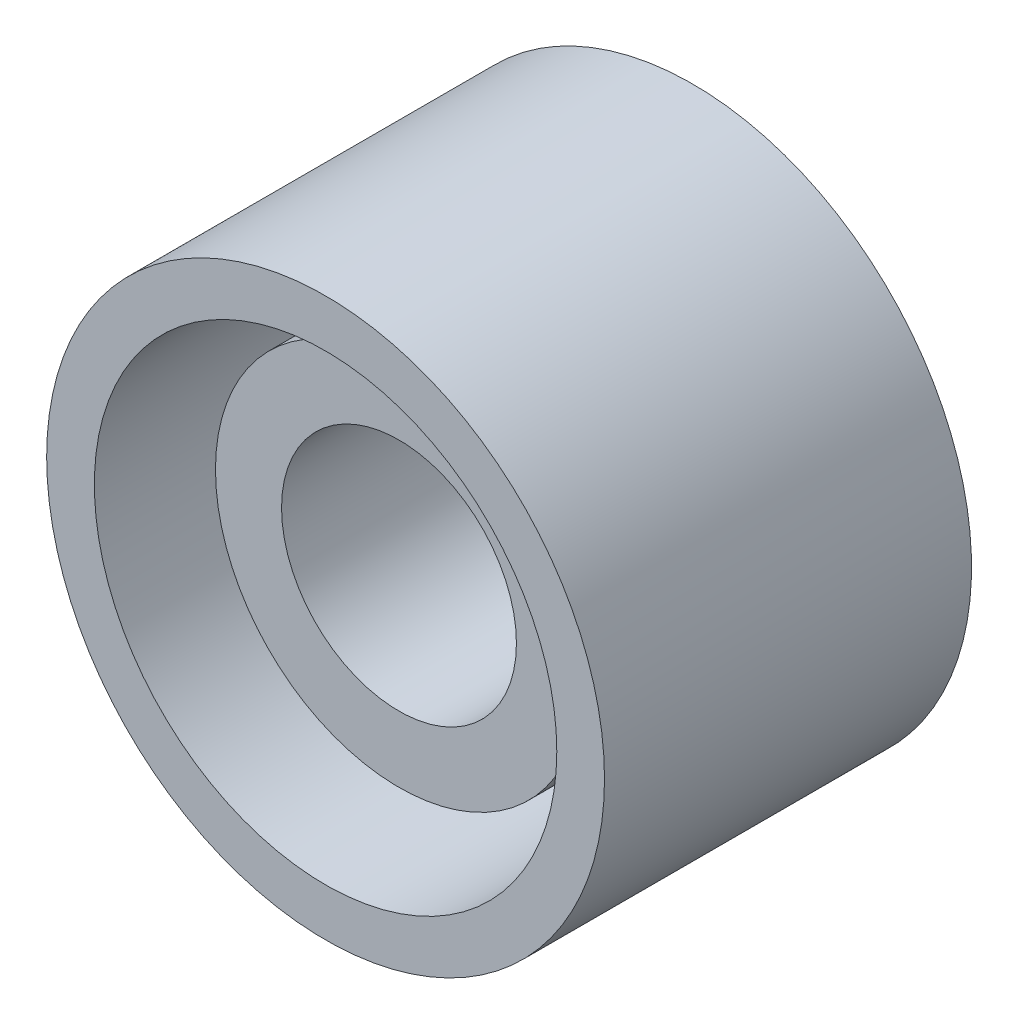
ISO-10303-21;
HEADER;
FILE_DESCRIPTION(('STEP AP214'),'2;1');
FILE_NAME('part.step','',(''),(''),'','','');
FILE_SCHEMA(('AUTOMOTIVE_DESIGN { 1 0 10303 214 1 1 1 1 }'));
ENDSEC;
DATA;
#1=APPLICATION_CONTEXT('core data for automotive mechanical design processes');
#2=APPLICATION_PROTOCOL_DEFINITION('international standard','automotive_design',2000,#1);
#3=PRODUCT_CONTEXT('',#1,'mechanical');
#4=PRODUCT('Part','Part','',(#3));
#5=PRODUCT_RELATED_PRODUCT_CATEGORY('part','',(#4));
#6=PRODUCT_DEFINITION_FORMATION('','',#4);
#7=PRODUCT_DEFINITION_CONTEXT('part definition',#1,'design');
#8=PRODUCT_DEFINITION('design','',#6,#7);
#9=PRODUCT_DEFINITION_SHAPE('','',#8);
#10=(LENGTH_UNIT() NAMED_UNIT(*) SI_UNIT(.MILLI.,.METRE.));
#11=(NAMED_UNIT(*) PLANE_ANGLE_UNIT() SI_UNIT($,.RADIAN.));
#12=(NAMED_UNIT(*) SI_UNIT($,.STERADIAN.) SOLID_ANGLE_UNIT());
#13=UNCERTAINTY_MEASURE_WITH_UNIT(LENGTH_MEASURE(1.E-05),#10,'distance_accuracy_value','');
#14=(GEOMETRIC_REPRESENTATION_CONTEXT(3) GLOBAL_UNCERTAINTY_ASSIGNED_CONTEXT((#13)) GLOBAL_UNIT_ASSIGNED_CONTEXT((#10,
#11,#12)) REPRESENTATION_CONTEXT('',''));
#15=CARTESIAN_POINT('',(0.,0.,0.));
#16=DIRECTION('',(0.,0.,1.));
#17=DIRECTION('',(1.,0.,0.));
#18=AXIS2_PLACEMENT_3D('',#15,#16,#17);
#19=CARTESIAN_POINT('',(0.,0.,30.));
#20=DIRECTION('',(0.,0.,1.));
#21=DIRECTION('',(1.,0.,0.));
#22=AXIS2_PLACEMENT_3D('',#19,#20,#21);
#23=PLANE('',#22);
#24=CARTESIAN_POINT('',(0.,0.,30.));
#25=DIRECTION('',(0.,0.,1.));
#26=DIRECTION('',(1.,0.,0.));
#27=AXIS2_PLACEMENT_3D('',#24,#25,#26);
#28=CIRCLE('',#27,38.);
#29=CARTESIAN_POINT('',(38.,0.,30.));
#30=VERTEX_POINT('',#29);
#31=EDGE_CURVE('E10',#30,#30,#28,.T.);
#32=ORIENTED_EDGE('',*,*,#31,.T.);
#33=EDGE_LOOP('',(#32));
#34=FACE_BOUND('',#33,.T.);
#35=CARTESIAN_POINT('',(0.,0.,30.));
#36=DIRECTION('',(0.,0.,1.));
#37=DIRECTION('',(1.,0.,0.));
#38=AXIS2_PLACEMENT_3D('',#35,#36,#37);
#39=CIRCLE('',#38,31.5);
#40=CARTESIAN_POINT('',(31.5,0.,30.));
#41=VERTEX_POINT('',#40);
#42=EDGE_CURVE('E45',#41,#41,#39,.T.);
#43=ORIENTED_EDGE('',*,*,#42,.F.);
#44=EDGE_LOOP('',(#43));
#45=FACE_BOUND('',#44,.T.);
#46=ADVANCED_FACE('F37',(#34,#45),#23,.T.);
#47=CARTESIAN_POINT('',(0.,0.,30.));
#48=DIRECTION('',(0.,0.,-1.));
#49=DIRECTION('',(-1.,0.,0.));
#50=AXIS2_PLACEMENT_3D('',#47,#48,#49);
#51=CYLINDRICAL_SURFACE('',#50,38.);
#52=ORIENTED_EDGE('',*,*,#31,.F.);
#53=EDGE_LOOP('',(#52));
#54=FACE_BOUND('',#53,.T.);
#55=CARTESIAN_POINT('',(0.,0.,-20.));
#56=DIRECTION('',(0.,0.,-1.));
#57=DIRECTION('',(-1.,0.,0.));
#58=AXIS2_PLACEMENT_3D('',#55,#56,#57);
#59=CIRCLE('',#58,38.);
#60=CARTESIAN_POINT('',(-38.,0.,-20.));
#61=VERTEX_POINT('',#60);
#62=EDGE_CURVE('E54',#61,#61,#59,.T.);
#63=ORIENTED_EDGE('',*,*,#62,.F.);
#64=EDGE_LOOP('',(#63));
#65=FACE_BOUND('',#64,.T.);
#66=ADVANCED_FACE('F39',(#54,#65),#51,.T.);
#67=CARTESIAN_POINT('',(0.,0.,30.));
#68=DIRECTION('',(0.,0.,-1.));
#69=DIRECTION('',(-1.,0.,0.));
#70=AXIS2_PLACEMENT_3D('',#67,#68,#69);
#71=CYLINDRICAL_SURFACE('',#70,31.5);
#72=ORIENTED_EDGE('',*,*,#42,.T.);
#73=EDGE_LOOP('',(#72));
#74=FACE_BOUND('',#73,.T.);
#75=CARTESIAN_POINT('',(0.,0.,0.));
#76=DIRECTION('',(0.,0.,1.));
#77=DIRECTION('',(1.,0.,0.));
#78=AXIS2_PLACEMENT_3D('',#75,#76,#77);
#79=CIRCLE('',#78,31.5);
#80=CARTESIAN_POINT('',(31.5,0.,0.));
#81=VERTEX_POINT('',#80);
#82=EDGE_CURVE('E49',#81,#81,#79,.T.);
#83=ORIENTED_EDGE('',*,*,#82,.F.);
#84=EDGE_LOOP('',(#83));
#85=FACE_BOUND('',#84,.T.);
#86=ADVANCED_FACE('F86',(#74,#85),#71,.F.);
#87=CARTESIAN_POINT('',(0.,0.,0.));
#88=DIRECTION('',(0.,0.,-1.));
#89=DIRECTION('',(-1.,0.,0.));
#90=AXIS2_PLACEMENT_3D('',#87,#88,#89);
#91=PLANE('',#90);
#92=CARTESIAN_POINT('',(0.,0.,0.));
#93=DIRECTION('',(0.,0.,-1.));
#94=DIRECTION('',(-1.,0.,0.));
#95=AXIS2_PLACEMENT_3D('',#92,#93,#94);
#96=CIRCLE('',#95,25.);
#97=CARTESIAN_POINT('',(-25.,0.,0.));
#98=VERTEX_POINT('',#97);
#99=EDGE_CURVE('E60',#98,#98,#96,.T.);
#100=ORIENTED_EDGE('',*,*,#99,.T.);
#101=EDGE_LOOP('',(#100));
#102=FACE_BOUND('',#101,.T.);
#103=ORIENTED_EDGE('',*,*,#82,.T.);
#104=EDGE_LOOP('',(#103));
#105=FACE_BOUND('',#104,.T.);
#106=ADVANCED_FACE('F91',(#102,#105),#91,.F.);
#107=CARTESIAN_POINT('',(0.,0.,-20.));
#108=DIRECTION('',(0.,0.,-1.));
#109=DIRECTION('',(-1.,0.,0.));
#110=AXIS2_PLACEMENT_3D('',#107,#108,#109);
#111=PLANE('',#110);
#112=CARTESIAN_POINT('',(0.,0.,-20.));
#113=DIRECTION('',(0.,0.,-1.));
#114=DIRECTION('',(-1.,0.,0.));
#115=AXIS2_PLACEMENT_3D('',#112,#113,#114);
#116=CIRCLE('',#115,16.);
#117=CARTESIAN_POINT('',(-16.,0.,-20.));
#118=VERTEX_POINT('',#117);
#119=EDGE_CURVE('E63',#118,#118,#116,.T.);
#120=ORIENTED_EDGE('',*,*,#119,.F.);
#121=EDGE_LOOP('',(#120));
#122=FACE_BOUND('',#121,.T.);
#123=ORIENTED_EDGE('',*,*,#62,.T.);
#124=EDGE_LOOP('',(#123));
#125=FACE_BOUND('',#124,.T.);
#126=ADVANCED_FACE('F93',(#122,#125),#111,.T.);
#127=CARTESIAN_POINT('',(0.,0.,20.));
#128=DIRECTION('',(0.,0.,-1.));
#129=DIRECTION('',(-1.,0.,0.));
#130=AXIS2_PLACEMENT_3D('',#127,#128,#129);
#131=CYLINDRICAL_SURFACE('',#130,25.);
#132=CARTESIAN_POINT('',(0.,0.,20.));
#133=DIRECTION('',(0.,0.,-1.));
#134=DIRECTION('',(-1.,0.,0.));
#135=AXIS2_PLACEMENT_3D('',#132,#133,#134);
#136=CIRCLE('',#135,25.);
#137=CARTESIAN_POINT('',(-25.,0.,20.));
#138=VERTEX_POINT('',#137);
#139=EDGE_CURVE('E57',#138,#138,#136,.T.);
#140=ORIENTED_EDGE('',*,*,#139,.T.);
#141=EDGE_LOOP('',(#140));
#142=FACE_BOUND('',#141,.T.);
#143=ORIENTED_EDGE('',*,*,#99,.F.);
#144=EDGE_LOOP('',(#143));
#145=FACE_BOUND('',#144,.T.);
#146=ADVANCED_FACE('F79',(#142,#145),#131,.T.);
#147=CARTESIAN_POINT('',(0.,0.,20.));
#148=DIRECTION('',(0.,0.,-1.));
#149=DIRECTION('',(-1.,0.,0.));
#150=AXIS2_PLACEMENT_3D('',#147,#148,#149);
#151=PLANE('',#150);
#152=CARTESIAN_POINT('',(0.,0.,20.));
#153=DIRECTION('',(0.,0.,-1.));
#154=DIRECTION('',(-1.,0.,0.));
#155=AXIS2_PLACEMENT_3D('',#152,#153,#154);
#156=CIRCLE('',#155,16.);
#157=CARTESIAN_POINT('',(-16.,0.,20.));
#158=VERTEX_POINT('',#157);
#159=EDGE_CURVE('E41',#158,#158,#156,.T.);
#160=ORIENTED_EDGE('',*,*,#159,.T.);
#161=EDGE_LOOP('',(#160));
#162=FACE_BOUND('',#161,.T.);
#163=ORIENTED_EDGE('',*,*,#139,.F.);
#164=EDGE_LOOP('',(#163));
#165=FACE_BOUND('',#164,.T.);
#166=ADVANCED_FACE('F70',(#162,#165),#151,.F.);
#167=CARTESIAN_POINT('',(0.,0.,30.));
#168=DIRECTION('',(0.,0.,-1.));
#169=DIRECTION('',(-1.,0.,0.));
#170=AXIS2_PLACEMENT_3D('',#167,#168,#169);
#171=CYLINDRICAL_SURFACE('',#170,16.);
#172=ORIENTED_EDGE('',*,*,#119,.T.);
#173=EDGE_LOOP('',(#172));
#174=FACE_BOUND('',#173,.T.);
#175=ORIENTED_EDGE('',*,*,#159,.F.);
#176=EDGE_LOOP('',(#175));
#177=FACE_BOUND('',#176,.T.);
#178=ADVANCED_FACE('F73',(#174,#177),#171,.F.);
#179=CLOSED_SHELL('',(#46,#66,#86,#106,#126,#146,#166,#178));
#180=MANIFOLD_SOLID_BREP('B2',#179);
#181=ADVANCED_BREP_SHAPE_REPRESENTATION('',(#18,#180),#14);
#182=SHAPE_DEFINITION_REPRESENTATION(#9,#181);
ENDSEC;
END-ISO-10303-21;
